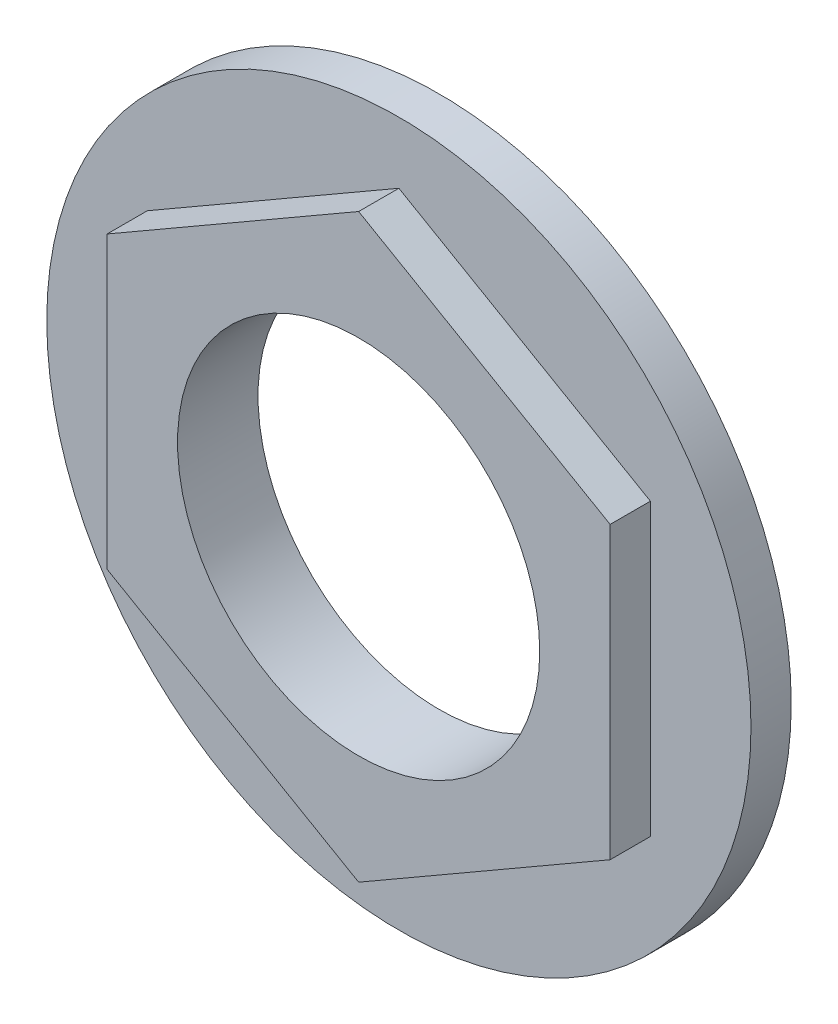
from build123d import *

# Parameters (mm, degrees)
SKETCH1_R           = 8.75
BOSS_EXTRUDE1_DEPTH = 1
BOSS_EXTRUDE2_DEPTH = 1
CUT_EXTRUDE1_REACH  = 14.535
SKETCH3_R           = 4.5


with BuildPart() as part:
    # Sketch1 → Boss-Extrude1 (new body)
    with BuildSketch(Plane.XY):
        Circle(SKETCH1_R)
    extrude(amount=BOSS_EXTRUDE1_DEPTH)

    # Sketch2 → Boss-Extrude2 (add)
    with BuildSketch(Plane.XY.offset(1)):
        Polygon((0, 7.216878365), (-6.25, 3.608439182), (-6.25, -3.608439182), (0, -7.216878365), (6.25, -3.608439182), (6.25, 3.608439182), align=None)
    extrude(amount=BOSS_EXTRUDE2_DEPTH)

    # Sketch3 → Cut-Extrude1 (cut, up to next)
    with BuildSketch(Plane.XY.offset(2), mode=Mode.PRIVATE) as cut_extrude1_sk1:
        Circle(SKETCH3_R)
    cut_extrude1_tool1 = extrude(cut_extrude1_sk1.sketch, amount=-CUT_EXTRUDE1_REACH, mode=Mode.PRIVATE) & part.part
    add(cut_extrude1_tool1.solids().sort_by_distance((0, 0, 2))[0], mode=Mode.SUBTRACT)


solid = part.part
